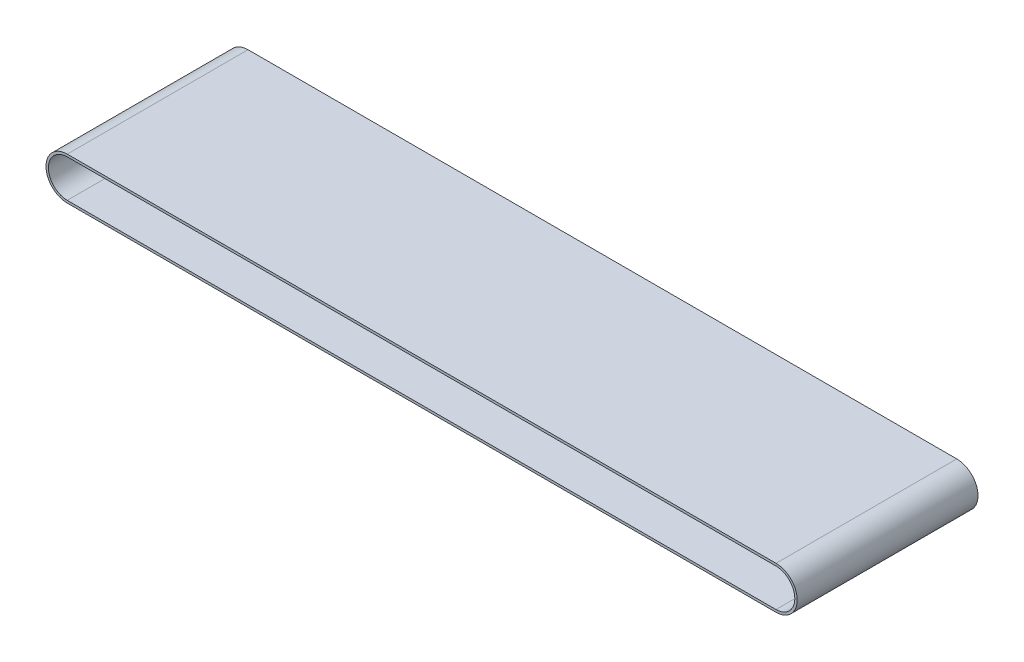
ISO-10303-21;
HEADER;
FILE_DESCRIPTION(('STEP AP214'),'2;1');
FILE_NAME('part.step','',(''),(''),'','','');
FILE_SCHEMA(('AUTOMOTIVE_DESIGN { 1 0 10303 214 1 1 1 1 }'));
ENDSEC;
DATA;
#1=APPLICATION_CONTEXT('core data for automotive mechanical design processes');
#2=APPLICATION_PROTOCOL_DEFINITION('international standard','automotive_design',2000,#1);
#3=PRODUCT_CONTEXT('',#1,'mechanical');
#4=PRODUCT('Part','Part','',(#3));
#5=PRODUCT_RELATED_PRODUCT_CATEGORY('part','',(#4));
#6=PRODUCT_DEFINITION_FORMATION('','',#4);
#7=PRODUCT_DEFINITION_CONTEXT('part definition',#1,'design');
#8=PRODUCT_DEFINITION('design','',#6,#7);
#9=PRODUCT_DEFINITION_SHAPE('','',#8);
#10=(LENGTH_UNIT() NAMED_UNIT(*) SI_UNIT(.MILLI.,.METRE.));
#11=(NAMED_UNIT(*) PLANE_ANGLE_UNIT() SI_UNIT($,.RADIAN.));
#12=(NAMED_UNIT(*) SI_UNIT($,.STERADIAN.) SOLID_ANGLE_UNIT());
#13=UNCERTAINTY_MEASURE_WITH_UNIT(LENGTH_MEASURE(1.E-05),#10,'distance_accuracy_value','');
#14=(GEOMETRIC_REPRESENTATION_CONTEXT(3) GLOBAL_UNCERTAINTY_ASSIGNED_CONTEXT((#13)) GLOBAL_UNIT_ASSIGNED_CONTEXT((#10,
#11,#12)) REPRESENTATION_CONTEXT('',''));
#15=CARTESIAN_POINT('',(0.,0.,0.));
#16=DIRECTION('',(0.,0.,1.));
#17=DIRECTION('',(1.,0.,0.));
#18=AXIS2_PLACEMENT_3D('',#15,#16,#17);
#19=CARTESIAN_POINT('',(0.,34.9999999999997,60.));
#20=DIRECTION('',(0.,1.,0.));
#21=DIRECTION('',(-1.,0.,0.));
#22=AXIS2_PLACEMENT_3D('',#19,#20,#21);
#23=PLANE('',#22);
#24=DIRECTION('',(1.,0.,0.));
#25=VECTOR('',#24,1.);
#26=CARTESIAN_POINT('',(0.,34.9999999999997,-60.));
#27=LINE('',#26,#25);
#28=CARTESIAN_POINT('',(-486.0125,34.9999999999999,-60.));
#29=VERTEX_POINT('',#28);
#30=CARTESIAN_POINT('',(-15.5750000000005,34.9999999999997,-60.));
#31=VERTEX_POINT('',#30);
#32=EDGE_CURVE('E150',#29,#31,#27,.T.);
#33=ORIENTED_EDGE('',*,*,#32,.F.);
#34=DIRECTION('',(0.,0.,-1.));
#35=VECTOR('',#34,1.);
#36=CARTESIAN_POINT('',(-486.0125,34.9999999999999,60.));
#37=LINE('',#36,#35);
#38=CARTESIAN_POINT('',(-486.0125,34.9999999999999,60.));
#39=VERTEX_POINT('',#38);
#40=EDGE_CURVE('E11',#39,#29,#37,.T.);
#41=ORIENTED_EDGE('',*,*,#40,.F.);
#42=DIRECTION('',(1.,0.,0.));
#43=VECTOR('',#42,1.);
#44=CARTESIAN_POINT('',(0.,34.9999999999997,60.));
#45=LINE('',#44,#43);
#46=CARTESIAN_POINT('',(-15.5750000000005,34.9999999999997,60.));
#47=VERTEX_POINT('',#46);
#48=EDGE_CURVE('E124',#39,#47,#45,.T.);
#49=ORIENTED_EDGE('',*,*,#48,.T.);
#50=DIRECTION('',(0.,0.,-1.));
#51=VECTOR('',#50,1.);
#52=CARTESIAN_POINT('',(-15.5750000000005,34.9999999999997,60.));
#53=LINE('',#52,#51);
#54=EDGE_CURVE('E90',#47,#31,#53,.T.);
#55=ORIENTED_EDGE('',*,*,#54,.T.);
#56=EDGE_LOOP('',(#33,#41,#49,#55));
#57=FACE_BOUND('',#56,.T.);
#58=ADVANCED_FACE('F37',(#57),#23,.T.);
#59=CARTESIAN_POINT('',(-486.0125,20.9124999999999,60.));
#60=DIRECTION('',(0.,0.,-1.));
#61=DIRECTION('',(-1.,0.,0.));
#62=AXIS2_PLACEMENT_3D('',#59,#60,#61);
#63=CYLINDRICAL_SURFACE('',#62,14.0875);
#64=CARTESIAN_POINT('',(-486.0125,20.9124999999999,-60.));
#65=DIRECTION('',(0.,0.,1.));
#66=DIRECTION('',(1.,0.,0.));
#67=AXIS2_PLACEMENT_3D('',#64,#65,#66);
#68=CIRCLE('',#67,14.0875);
#69=CARTESIAN_POINT('',(-486.0125,6.82499999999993,-60.));
#70=VERTEX_POINT('',#69);
#71=EDGE_CURVE('E129',#29,#70,#68,.T.);
#72=ORIENTED_EDGE('',*,*,#71,.T.);
#73=DIRECTION('',(0.,0.,-1.));
#74=VECTOR('',#73,1.);
#75=CARTESIAN_POINT('',(-486.0125,6.82499999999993,60.));
#76=LINE('',#75,#74);
#77=CARTESIAN_POINT('',(-486.0125,6.82499999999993,60.));
#78=VERTEX_POINT('',#77);
#79=EDGE_CURVE('E47',#78,#70,#76,.T.);
#80=ORIENTED_EDGE('',*,*,#79,.F.);
#81=CARTESIAN_POINT('',(-486.0125,20.9124999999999,60.));
#82=DIRECTION('',(0.,0.,1.));
#83=DIRECTION('',(1.,0.,0.));
#84=AXIS2_PLACEMENT_3D('',#81,#82,#83);
#85=CIRCLE('',#84,14.0875);
#86=EDGE_CURVE('E120',#39,#78,#85,.T.);
#87=ORIENTED_EDGE('',*,*,#86,.F.);
#88=ORIENTED_EDGE('',*,*,#40,.T.);
#89=EDGE_LOOP('',(#72,#80,#87,#88));
#90=FACE_BOUND('',#89,.T.);
#91=ADVANCED_FACE('F127',(#90),#63,.T.);
#92=CARTESIAN_POINT('',(0.,6.82499999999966,60.));
#93=DIRECTION('',(0.,1.,0.));
#94=DIRECTION('',(-1.,0.,0.));
#95=AXIS2_PLACEMENT_3D('',#92,#93,#94);
#96=PLANE('',#95);
#97=DIRECTION('',(1.,0.,0.));
#98=VECTOR('',#97,1.);
#99=CARTESIAN_POINT('',(0.,6.82499999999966,-60.));
#100=LINE('',#99,#98);
#101=CARTESIAN_POINT('',(-15.5750000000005,6.82499999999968,-60.));
#102=VERTEX_POINT('',#101);
#103=EDGE_CURVE('E147',#70,#102,#100,.T.);
#104=ORIENTED_EDGE('',*,*,#103,.T.);
#105=DIRECTION('',(0.,0.,-1.));
#106=VECTOR('',#105,1.);
#107=CARTESIAN_POINT('',(-15.5750000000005,6.82499999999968,60.));
#108=LINE('',#107,#106);
#109=CARTESIAN_POINT('',(-15.5750000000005,6.82499999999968,60.));
#110=VERTEX_POINT('',#109);
#111=EDGE_CURVE('E119',#110,#102,#108,.T.);
#112=ORIENTED_EDGE('',*,*,#111,.F.);
#113=DIRECTION('',(1.,0.,0.));
#114=VECTOR('',#113,1.);
#115=CARTESIAN_POINT('',(0.,6.82499999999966,60.));
#116=LINE('',#115,#114);
#117=EDGE_CURVE('E113',#78,#110,#116,.T.);
#118=ORIENTED_EDGE('',*,*,#117,.F.);
#119=ORIENTED_EDGE('',*,*,#79,.T.);
#120=EDGE_LOOP('',(#104,#112,#118,#119));
#121=FACE_BOUND('',#120,.T.);
#122=ADVANCED_FACE('F116',(#121),#96,.F.);
#123=CARTESIAN_POINT('',(-15.5750000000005,20.9124999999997,60.));
#124=DIRECTION('',(0.,0.,-1.));
#125=DIRECTION('',(-1.,0.,0.));
#126=AXIS2_PLACEMENT_3D('',#123,#124,#125);
#127=CYLINDRICAL_SURFACE('',#126,12.5);
#128=CARTESIAN_POINT('',(-15.5750000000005,20.9124999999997,-60.));
#129=DIRECTION('',(0.,0.,1.));
#130=DIRECTION('',(1.,0.,0.));
#131=AXIS2_PLACEMENT_3D('',#128,#129,#130);
#132=CIRCLE('',#131,12.5);
#133=CARTESIAN_POINT('',(-15.5750000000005,8.41249999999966,-60.));
#134=VERTEX_POINT('',#133);
#135=CARTESIAN_POINT('',(-15.5750000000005,33.4124999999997,-60.));
#136=VERTEX_POINT('',#135);
#137=EDGE_CURVE('E161',#134,#136,#132,.T.);
#138=ORIENTED_EDGE('',*,*,#137,.F.);
#139=DIRECTION('',(0.,0.,-1.));
#140=VECTOR('',#139,1.);
#141=CARTESIAN_POINT('',(-15.5750000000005,8.41249999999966,60.));
#142=LINE('',#141,#140);
#143=CARTESIAN_POINT('',(-15.5750000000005,8.41249999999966,60.));
#144=VERTEX_POINT('',#143);
#145=EDGE_CURVE('E41',#144,#134,#142,.T.);
#146=ORIENTED_EDGE('',*,*,#145,.F.);
#147=CARTESIAN_POINT('',(-15.5750000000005,20.9124999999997,60.));
#148=DIRECTION('',(0.,0.,1.));
#149=DIRECTION('',(1.,0.,0.));
#150=AXIS2_PLACEMENT_3D('',#147,#148,#149);
#151=CIRCLE('',#150,12.5);
#152=CARTESIAN_POINT('',(-15.5750000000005,33.4124999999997,60.));
#153=VERTEX_POINT('',#152);
#154=EDGE_CURVE('E146',#144,#153,#151,.T.);
#155=ORIENTED_EDGE('',*,*,#154,.T.);
#156=DIRECTION('',(0.,0.,-1.));
#157=VECTOR('',#156,1.);
#158=CARTESIAN_POINT('',(-15.5750000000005,33.4124999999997,60.));
#159=LINE('',#158,#157);
#160=EDGE_CURVE('E134',#153,#136,#159,.T.);
#161=ORIENTED_EDGE('',*,*,#160,.T.);
#162=EDGE_LOOP('',(#138,#146,#155,#161));
#163=FACE_BOUND('',#162,.T.);
#164=ADVANCED_FACE('F39',(#163),#127,.F.);
#165=CARTESIAN_POINT('',(0.,8.41249999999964,60.));
#166=DIRECTION('',(0.,1.,0.));
#167=DIRECTION('',(-1.,0.,0.));
#168=AXIS2_PLACEMENT_3D('',#165,#166,#167);
#169=PLANE('',#168);
#170=DIRECTION('',(1.,0.,0.));
#171=VECTOR('',#170,1.);
#172=CARTESIAN_POINT('',(0.,8.41249999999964,-60.));
#173=LINE('',#172,#171);
#174=CARTESIAN_POINT('',(-486.0125,8.41249999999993,-60.));
#175=VERTEX_POINT('',#174);
#176=EDGE_CURVE('E158',#175,#134,#173,.T.);
#177=ORIENTED_EDGE('',*,*,#176,.F.);
#178=DIRECTION('',(0.,0.,-1.));
#179=VECTOR('',#178,1.);
#180=CARTESIAN_POINT('',(-486.0125,8.41249999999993,60.));
#181=LINE('',#180,#179);
#182=CARTESIAN_POINT('',(-486.0125,8.41249999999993,60.));
#183=VERTEX_POINT('',#182);
#184=EDGE_CURVE('E137',#183,#175,#181,.T.);
#185=ORIENTED_EDGE('',*,*,#184,.F.);
#186=DIRECTION('',(1.,0.,0.));
#187=VECTOR('',#186,1.);
#188=CARTESIAN_POINT('',(0.,8.41249999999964,60.));
#189=LINE('',#188,#187);
#190=EDGE_CURVE('E170',#183,#144,#189,.T.);
#191=ORIENTED_EDGE('',*,*,#190,.T.);
#192=ORIENTED_EDGE('',*,*,#145,.T.);
#193=EDGE_LOOP('',(#177,#185,#191,#192));
#194=FACE_BOUND('',#193,.T.);
#195=ADVANCED_FACE('F177',(#194),#169,.T.);
#196=CARTESIAN_POINT('',(-486.0125,20.9124999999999,60.));
#197=DIRECTION('',(0.,0.,-1.));
#198=DIRECTION('',(-1.,0.,0.));
#199=AXIS2_PLACEMENT_3D('',#196,#197,#198);
#200=CYLINDRICAL_SURFACE('',#199,12.5);
#201=CARTESIAN_POINT('',(-486.0125,20.9124999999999,-60.));
#202=DIRECTION('',(0.,0.,1.));
#203=DIRECTION('',(1.,0.,0.));
#204=AXIS2_PLACEMENT_3D('',#201,#202,#203);
#205=CIRCLE('',#204,12.5);
#206=CARTESIAN_POINT('',(-486.0125,33.4124999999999,-60.));
#207=VERTEX_POINT('',#206);
#208=EDGE_CURVE('E155',#207,#175,#205,.T.);
#209=ORIENTED_EDGE('',*,*,#208,.F.);
#210=DIRECTION('',(0.,0.,-1.));
#211=VECTOR('',#210,1.);
#212=CARTESIAN_POINT('',(-486.0125,33.4124999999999,60.));
#213=LINE('',#212,#211);
#214=CARTESIAN_POINT('',(-486.0125,33.4124999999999,60.));
#215=VERTEX_POINT('',#214);
#216=EDGE_CURVE('E136',#215,#207,#213,.T.);
#217=ORIENTED_EDGE('',*,*,#216,.F.);
#218=CARTESIAN_POINT('',(-486.0125,20.9124999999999,60.));
#219=DIRECTION('',(0.,0.,1.));
#220=DIRECTION('',(1.,0.,0.));
#221=AXIS2_PLACEMENT_3D('',#218,#219,#220);
#222=CIRCLE('',#221,12.5);
#223=EDGE_CURVE('E168',#215,#183,#222,.T.);
#224=ORIENTED_EDGE('',*,*,#223,.T.);
#225=ORIENTED_EDGE('',*,*,#184,.T.);
#226=EDGE_LOOP('',(#209,#217,#224,#225));
#227=FACE_BOUND('',#226,.T.);
#228=ADVANCED_FACE('F181',(#227),#200,.F.);
#229=CARTESIAN_POINT('',(0.,33.4124999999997,60.));
#230=DIRECTION('',(0.,1.,0.));
#231=DIRECTION('',(-1.,0.,0.));
#232=AXIS2_PLACEMENT_3D('',#229,#230,#231);
#233=PLANE('',#232);
#234=DIRECTION('',(1.,0.,0.));
#235=VECTOR('',#234,1.);
#236=CARTESIAN_POINT('',(0.,33.4124999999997,-60.));
#237=LINE('',#236,#235);
#238=EDGE_CURVE('E152',#207,#136,#237,.T.);
#239=ORIENTED_EDGE('',*,*,#238,.T.);
#240=ORIENTED_EDGE('',*,*,#160,.F.);
#241=DIRECTION('',(1.,0.,0.));
#242=VECTOR('',#241,1.);
#243=CARTESIAN_POINT('',(0.,33.4124999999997,60.));
#244=LINE('',#243,#242);
#245=EDGE_CURVE('E166',#215,#153,#244,.T.);
#246=ORIENTED_EDGE('',*,*,#245,.F.);
#247=ORIENTED_EDGE('',*,*,#216,.T.);
#248=EDGE_LOOP('',(#239,#240,#246,#247));
#249=FACE_BOUND('',#248,.T.);
#250=ADVANCED_FACE('F183',(#249),#233,.F.);
#251=CARTESIAN_POINT('',(-15.5750000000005,20.9124999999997,60.));
#252=DIRECTION('',(0.,0.,-1.));
#253=DIRECTION('',(-1.,0.,0.));
#254=AXIS2_PLACEMENT_3D('',#251,#252,#253);
#255=CYLINDRICAL_SURFACE('',#254,14.0875);
#256=CARTESIAN_POINT('',(-15.5750000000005,20.9124999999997,-60.));
#257=DIRECTION('',(0.,0.,1.));
#258=DIRECTION('',(1.,0.,0.));
#259=AXIS2_PLACEMENT_3D('',#256,#257,#258);
#260=CIRCLE('',#259,14.0875);
#261=EDGE_CURVE('E83',#102,#31,#260,.T.);
#262=ORIENTED_EDGE('',*,*,#261,.T.);
#263=ORIENTED_EDGE('',*,*,#54,.F.);
#264=CARTESIAN_POINT('',(-15.5750000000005,20.9124999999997,60.));
#265=DIRECTION('',(0.,0.,1.));
#266=DIRECTION('',(1.,0.,0.));
#267=AXIS2_PLACEMENT_3D('',#264,#265,#266);
#268=CIRCLE('',#267,14.0875);
#269=EDGE_CURVE('E56',#110,#47,#268,.T.);
#270=ORIENTED_EDGE('',*,*,#269,.F.);
#271=ORIENTED_EDGE('',*,*,#111,.T.);
#272=EDGE_LOOP('',(#262,#263,#270,#271));
#273=FACE_BOUND('',#272,.T.);
#274=ADVANCED_FACE('F185',(#273),#255,.T.);
#275=CARTESIAN_POINT('',(0.,0.,60.));
#276=DIRECTION('',(0.,0.,1.));
#277=DIRECTION('',(1.,0.,0.));
#278=AXIS2_PLACEMENT_3D('',#275,#276,#277);
#279=PLANE('',#278);
#280=ORIENTED_EDGE('',*,*,#154,.F.);
#281=ORIENTED_EDGE('',*,*,#190,.F.);
#282=ORIENTED_EDGE('',*,*,#223,.F.);
#283=ORIENTED_EDGE('',*,*,#245,.T.);
#284=EDGE_LOOP('',(#280,#281,#282,#283));
#285=FACE_BOUND('',#284,.T.);
#286=ORIENTED_EDGE('',*,*,#48,.F.);
#287=ORIENTED_EDGE('',*,*,#86,.T.);
#288=ORIENTED_EDGE('',*,*,#117,.T.);
#289=ORIENTED_EDGE('',*,*,#269,.T.);
#290=EDGE_LOOP('',(#286,#287,#288,#289));
#291=FACE_BOUND('',#290,.T.);
#292=ADVANCED_FACE('F123',(#285,#291),#279,.T.);
#293=CARTESIAN_POINT('',(0.,0.,-60.));
#294=DIRECTION('',(0.,0.,1.));
#295=DIRECTION('',(1.,0.,0.));
#296=AXIS2_PLACEMENT_3D('',#293,#294,#295);
#297=PLANE('',#296);
#298=ORIENTED_EDGE('',*,*,#137,.T.);
#299=ORIENTED_EDGE('',*,*,#238,.F.);
#300=ORIENTED_EDGE('',*,*,#208,.T.);
#301=ORIENTED_EDGE('',*,*,#176,.T.);
#302=EDGE_LOOP('',(#298,#299,#300,#301));
#303=FACE_BOUND('',#302,.T.);
#304=ORIENTED_EDGE('',*,*,#32,.T.);
#305=ORIENTED_EDGE('',*,*,#261,.F.);
#306=ORIENTED_EDGE('',*,*,#103,.F.);
#307=ORIENTED_EDGE('',*,*,#71,.F.);
#308=EDGE_LOOP('',(#304,#305,#306,#307));
#309=FACE_BOUND('',#308,.T.);
#310=ADVANCED_FACE('F180',(#303,#309),#297,.F.);
#311=CLOSED_SHELL('',(#58,#91,#122,#164,#195,#228,#250,#274,#292,#310));
#312=MANIFOLD_SOLID_BREP('B2',#311);
#313=ADVANCED_BREP_SHAPE_REPRESENTATION('',(#18,#312),#14);
#314=SHAPE_DEFINITION_REPRESENTATION(#9,#313);
ENDSEC;
END-ISO-10303-21;
